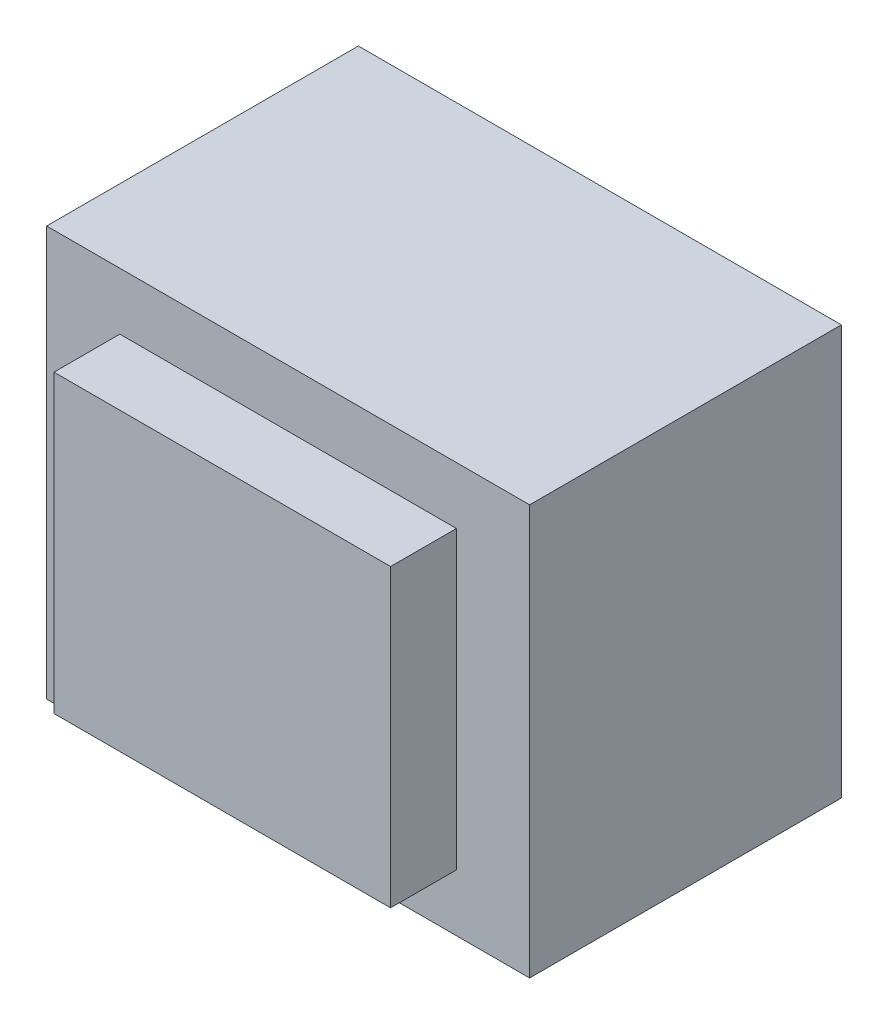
ISO-10303-21;
HEADER;
FILE_DESCRIPTION(('STEP AP214'),'2;1');
FILE_NAME('part.step','',(''),(''),'','','');
FILE_SCHEMA(('AUTOMOTIVE_DESIGN { 1 0 10303 214 1 1 1 1 }'));
ENDSEC;
DATA;
#1=APPLICATION_CONTEXT('core data for automotive mechanical design processes');
#2=APPLICATION_PROTOCOL_DEFINITION('international standard','automotive_design',2000,#1);
#3=PRODUCT_CONTEXT('',#1,'mechanical');
#4=PRODUCT('Part','Part','',(#3));
#5=PRODUCT_RELATED_PRODUCT_CATEGORY('part','',(#4));
#6=PRODUCT_DEFINITION_FORMATION('','',#4);
#7=PRODUCT_DEFINITION_CONTEXT('part definition',#1,'design');
#8=PRODUCT_DEFINITION('design','',#6,#7);
#9=PRODUCT_DEFINITION_SHAPE('','',#8);
#10=(LENGTH_UNIT() NAMED_UNIT(*) SI_UNIT(.MILLI.,.METRE.));
#11=(NAMED_UNIT(*) PLANE_ANGLE_UNIT() SI_UNIT($,.RADIAN.));
#12=(NAMED_UNIT(*) SI_UNIT($,.STERADIAN.) SOLID_ANGLE_UNIT());
#13=UNCERTAINTY_MEASURE_WITH_UNIT(LENGTH_MEASURE(1.E-05),#10,'distance_accuracy_value','');
#14=(GEOMETRIC_REPRESENTATION_CONTEXT(3) GLOBAL_UNCERTAINTY_ASSIGNED_CONTEXT((#13)) GLOBAL_UNIT_ASSIGNED_CONTEXT((#10,
#11,#12)) REPRESENTATION_CONTEXT('',''));
#15=CARTESIAN_POINT('',(0.,0.,0.));
#16=DIRECTION('',(0.,0.,1.));
#17=DIRECTION('',(1.,0.,0.));
#18=AXIS2_PLACEMENT_3D('',#15,#16,#17);
#19=CARTESIAN_POINT('',(-10.,-10.2757465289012,-2.54));
#20=DIRECTION('',(0.,0.,1.));
#21=DIRECTION('',(1.,0.,0.));
#22=AXIS2_PLACEMENT_3D('',#19,#20,#21);
#23=CYLINDRICAL_SURFACE('',#22,0.999999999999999);
#24=CARTESIAN_POINT('',(-10.,-10.2757465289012,-2.54));
#25=DIRECTION('',(0.,0.,-1.));
#26=DIRECTION('',(-1.,0.,0.));
#27=AXIS2_PLACEMENT_3D('',#24,#25,#26);
#28=CIRCLE('',#27,0.999999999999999);
#29=CARTESIAN_POINT('',(-11.,-10.2757465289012,-2.54));
#30=VERTEX_POINT('',#29);
#31=EDGE_CURVE('E11',#30,#30,#28,.T.);
#32=ORIENTED_EDGE('',*,*,#31,.F.);
#33=EDGE_LOOP('',(#32));
#34=FACE_BOUND('',#33,.T.);
#35=CARTESIAN_POINT('',(-10.,-10.2757465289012,0.));
#36=DIRECTION('',(0.,0.,-1.));
#37=DIRECTION('',(-1.,0.,0.));
#38=AXIS2_PLACEMENT_3D('',#35,#36,#37);
#39=CIRCLE('',#38,0.999999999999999);
#40=CARTESIAN_POINT('',(-11.,-10.2757465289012,0.));
#41=VERTEX_POINT('',#40);
#42=EDGE_CURVE('E41',#41,#41,#39,.T.);
#43=ORIENTED_EDGE('',*,*,#42,.T.);
#44=EDGE_LOOP('',(#43));
#45=FACE_BOUND('',#44,.T.);
#46=ADVANCED_FACE('F38',(#34,#45),#23,.T.);
#47=CARTESIAN_POINT('',(-10.,-10.2757465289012,-2.54));
#48=DIRECTION('',(0.,0.,-1.));
#49=DIRECTION('',(-1.,0.,0.));
#50=AXIS2_PLACEMENT_3D('',#47,#48,#49);
#51=PLANE('',#50);
#52=ORIENTED_EDGE('',*,*,#31,.T.);
#53=EDGE_LOOP('',(#52));
#54=FACE_BOUND('',#53,.T.);
#55=ADVANCED_FACE('F53',(#54),#51,.T.);
#56=CARTESIAN_POINT('',(-10.,-10.2757465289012,0.));
#57=DIRECTION('',(0.,0.,-1.));
#58=DIRECTION('',(-1.,0.,0.));
#59=AXIS2_PLACEMENT_3D('',#56,#57,#58);
#60=PLANE('',#59);
#61=ORIENTED_EDGE('',*,*,#42,.F.);
#62=EDGE_LOOP('',(#61));
#63=FACE_BOUND('',#62,.T.);
#64=ADVANCED_FACE('F51',(#63),#60,.F.);
#65=CLOSED_SHELL('',(#46,#55,#64));
#66=MANIFOLD_SOLID_BREP('B2',#65);
#67=CARTESIAN_POINT('',(-5.,-10.,-2.54));
#68=DIRECTION('',(0.,0.,1.));
#69=DIRECTION('',(1.,0.,0.));
#70=AXIS2_PLACEMENT_3D('',#67,#68,#69);
#71=CYLINDRICAL_SURFACE('',#70,1.);
#72=CARTESIAN_POINT('',(-5.,-10.,-2.54));
#73=DIRECTION('',(0.,0.,-1.));
#74=DIRECTION('',(-1.,0.,0.));
#75=AXIS2_PLACEMENT_3D('',#72,#73,#74);
#76=CIRCLE('',#75,1.);
#77=CARTESIAN_POINT('',(-6.,-10.,-2.54));
#78=VERTEX_POINT('',#77);
#79=EDGE_CURVE('E37',#78,#78,#76,.T.);
#80=ORIENTED_EDGE('',*,*,#79,.F.);
#81=EDGE_LOOP('',(#80));
#82=FACE_BOUND('',#81,.T.);
#83=CARTESIAN_POINT('',(-5.,-10.,0.));
#84=DIRECTION('',(0.,0.,-1.));
#85=DIRECTION('',(-1.,0.,0.));
#86=AXIS2_PLACEMENT_3D('',#83,#84,#85);
#87=CIRCLE('',#86,1.);
#88=CARTESIAN_POINT('',(-6.,-10.,0.));
#89=VERTEX_POINT('',#88);
#90=EDGE_CURVE('E90',#89,#89,#87,.T.);
#91=ORIENTED_EDGE('',*,*,#90,.T.);
#92=EDGE_LOOP('',(#91));
#93=FACE_BOUND('',#92,.T.);
#94=ADVANCED_FACE('F87',(#82,#93),#71,.T.);
#95=CARTESIAN_POINT('',(-5.,-10.,-2.54));
#96=DIRECTION('',(0.,0.,-1.));
#97=DIRECTION('',(-1.,0.,0.));
#98=AXIS2_PLACEMENT_3D('',#95,#96,#97);
#99=PLANE('',#98);
#100=ORIENTED_EDGE('',*,*,#79,.T.);
#101=EDGE_LOOP('',(#100));
#102=FACE_BOUND('',#101,.T.);
#103=ADVANCED_FACE('F102',(#102),#99,.T.);
#104=CARTESIAN_POINT('',(-5.,-10.,0.));
#105=DIRECTION('',(0.,0.,-1.));
#106=DIRECTION('',(-1.,0.,0.));
#107=AXIS2_PLACEMENT_3D('',#104,#105,#106);
#108=PLANE('',#107);
#109=ORIENTED_EDGE('',*,*,#90,.F.);
#110=EDGE_LOOP('',(#109));
#111=FACE_BOUND('',#110,.T.);
#112=ADVANCED_FACE('F100',(#111),#108,.F.);
#113=CLOSED_SHELL('',(#94,#103,#112));
#114=MANIFOLD_SOLID_BREP('B6',#113);
#115=CARTESIAN_POINT('',(0.,-10.,-2.54));
#116=DIRECTION('',(0.,0.,1.));
#117=DIRECTION('',(1.,0.,0.));
#118=AXIS2_PLACEMENT_3D('',#115,#116,#117);
#119=CYLINDRICAL_SURFACE('',#118,1.);
#120=CARTESIAN_POINT('',(0.,-10.,-2.54));
#121=DIRECTION('',(0.,0.,-1.));
#122=DIRECTION('',(-1.,0.,0.));
#123=AXIS2_PLACEMENT_3D('',#120,#121,#122);
#124=CIRCLE('',#123,1.);
#125=CARTESIAN_POINT('',(-1.,-10.,-2.54));
#126=VERTEX_POINT('',#125);
#127=EDGE_CURVE('E86',#126,#126,#124,.T.);
#128=ORIENTED_EDGE('',*,*,#127,.F.);
#129=EDGE_LOOP('',(#128));
#130=FACE_BOUND('',#129,.T.);
#131=CARTESIAN_POINT('',(0.,-10.,0.));
#132=DIRECTION('',(0.,0.,-1.));
#133=DIRECTION('',(-1.,0.,0.));
#134=AXIS2_PLACEMENT_3D('',#131,#132,#133);
#135=CIRCLE('',#134,1.);
#136=CARTESIAN_POINT('',(-1.,-10.,0.));
#137=VERTEX_POINT('',#136);
#138=EDGE_CURVE('E139',#137,#137,#135,.T.);
#139=ORIENTED_EDGE('',*,*,#138,.T.);
#140=EDGE_LOOP('',(#139));
#141=FACE_BOUND('',#140,.T.);
#142=ADVANCED_FACE('F136',(#130,#141),#119,.T.);
#143=CARTESIAN_POINT('',(0.,-10.,-2.54));
#144=DIRECTION('',(0.,0.,-1.));
#145=DIRECTION('',(-1.,0.,0.));
#146=AXIS2_PLACEMENT_3D('',#143,#144,#145);
#147=PLANE('',#146);
#148=ORIENTED_EDGE('',*,*,#127,.T.);
#149=EDGE_LOOP('',(#148));
#150=FACE_BOUND('',#149,.T.);
#151=ADVANCED_FACE('F151',(#150),#147,.T.);
#152=CARTESIAN_POINT('',(0.,-10.,0.));
#153=DIRECTION('',(0.,0.,-1.));
#154=DIRECTION('',(-1.,0.,0.));
#155=AXIS2_PLACEMENT_3D('',#152,#153,#154);
#156=PLANE('',#155);
#157=ORIENTED_EDGE('',*,*,#138,.F.);
#158=EDGE_LOOP('',(#157));
#159=FACE_BOUND('',#158,.T.);
#160=ADVANCED_FACE('F149',(#159),#156,.F.);
#161=CLOSED_SHELL('',(#142,#151,#160));
#162=MANIFOLD_SOLID_BREP('B32',#161);
#163=CARTESIAN_POINT('',(5.,-10.,-2.54));
#164=DIRECTION('',(0.,0.,1.));
#165=DIRECTION('',(1.,0.,0.));
#166=AXIS2_PLACEMENT_3D('',#163,#164,#165);
#167=CYLINDRICAL_SURFACE('',#166,1.);
#168=CARTESIAN_POINT('',(5.,-10.,-2.54));
#169=DIRECTION('',(0.,0.,-1.));
#170=DIRECTION('',(-1.,0.,0.));
#171=AXIS2_PLACEMENT_3D('',#168,#169,#170);
#172=CIRCLE('',#171,1.);
#173=CARTESIAN_POINT('',(4.,-10.,-2.54));
#174=VERTEX_POINT('',#173);
#175=EDGE_CURVE('E135',#174,#174,#172,.T.);
#176=ORIENTED_EDGE('',*,*,#175,.F.);
#177=EDGE_LOOP('',(#176));
#178=FACE_BOUND('',#177,.T.);
#179=CARTESIAN_POINT('',(5.,-10.,0.));
#180=DIRECTION('',(0.,0.,-1.));
#181=DIRECTION('',(-1.,0.,0.));
#182=AXIS2_PLACEMENT_3D('',#179,#180,#181);
#183=CIRCLE('',#182,1.);
#184=CARTESIAN_POINT('',(4.,-10.,0.));
#185=VERTEX_POINT('',#184);
#186=EDGE_CURVE('E188',#185,#185,#183,.T.);
#187=ORIENTED_EDGE('',*,*,#186,.T.);
#188=EDGE_LOOP('',(#187));
#189=FACE_BOUND('',#188,.T.);
#190=ADVANCED_FACE('F185',(#178,#189),#167,.T.);
#191=CARTESIAN_POINT('',(5.,-10.,-2.54));
#192=DIRECTION('',(0.,0.,-1.));
#193=DIRECTION('',(-1.,0.,0.));
#194=AXIS2_PLACEMENT_3D('',#191,#192,#193);
#195=PLANE('',#194);
#196=ORIENTED_EDGE('',*,*,#175,.T.);
#197=EDGE_LOOP('',(#196));
#198=FACE_BOUND('',#197,.T.);
#199=ADVANCED_FACE('F200',(#198),#195,.T.);
#200=CARTESIAN_POINT('',(5.,-10.,0.));
#201=DIRECTION('',(0.,0.,-1.));
#202=DIRECTION('',(-1.,0.,0.));
#203=AXIS2_PLACEMENT_3D('',#200,#201,#202);
#204=PLANE('',#203);
#205=ORIENTED_EDGE('',*,*,#186,.F.);
#206=EDGE_LOOP('',(#205));
#207=FACE_BOUND('',#206,.T.);
#208=ADVANCED_FACE('F198',(#207),#204,.F.);
#209=CLOSED_SHELL('',(#190,#199,#208));
#210=MANIFOLD_SOLID_BREP('B81',#209);
#211=CARTESIAN_POINT('',(10.,-10.,-2.54));
#212=DIRECTION('',(0.,0.,1.));
#213=DIRECTION('',(1.,0.,0.));
#214=AXIS2_PLACEMENT_3D('',#211,#212,#213);
#215=CYLINDRICAL_SURFACE('',#214,0.999999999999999);
#216=CARTESIAN_POINT('',(10.,-10.,-2.54));
#217=DIRECTION('',(0.,0.,-1.));
#218=DIRECTION('',(-1.,0.,0.));
#219=AXIS2_PLACEMENT_3D('',#216,#217,#218);
#220=CIRCLE('',#219,0.999999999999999);
#221=CARTESIAN_POINT('',(9.,-10.,-2.54));
#222=VERTEX_POINT('',#221);
#223=EDGE_CURVE('E184',#222,#222,#220,.T.);
#224=ORIENTED_EDGE('',*,*,#223,.F.);
#225=EDGE_LOOP('',(#224));
#226=FACE_BOUND('',#225,.T.);
#227=CARTESIAN_POINT('',(10.,-10.,0.));
#228=DIRECTION('',(0.,0.,-1.));
#229=DIRECTION('',(-1.,0.,0.));
#230=AXIS2_PLACEMENT_3D('',#227,#228,#229);
#231=CIRCLE('',#230,0.999999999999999);
#232=CARTESIAN_POINT('',(9.,-10.,0.));
#233=VERTEX_POINT('',#232);
#234=EDGE_CURVE('E237',#233,#233,#231,.T.);
#235=ORIENTED_EDGE('',*,*,#234,.T.);
#236=EDGE_LOOP('',(#235));
#237=FACE_BOUND('',#236,.T.);
#238=ADVANCED_FACE('F234',(#226,#237),#215,.T.);
#239=CARTESIAN_POINT('',(10.,-10.,-2.54));
#240=DIRECTION('',(0.,0.,-1.));
#241=DIRECTION('',(-1.,0.,0.));
#242=AXIS2_PLACEMENT_3D('',#239,#240,#241);
#243=PLANE('',#242);
#244=ORIENTED_EDGE('',*,*,#223,.T.);
#245=EDGE_LOOP('',(#244));
#246=FACE_BOUND('',#245,.T.);
#247=ADVANCED_FACE('F249',(#246),#243,.T.);
#248=CARTESIAN_POINT('',(10.,-10.,0.));
#249=DIRECTION('',(0.,0.,-1.));
#250=DIRECTION('',(-1.,0.,0.));
#251=AXIS2_PLACEMENT_3D('',#248,#249,#250);
#252=PLANE('',#251);
#253=ORIENTED_EDGE('',*,*,#234,.F.);
#254=EDGE_LOOP('',(#253));
#255=FACE_BOUND('',#254,.T.);
#256=ADVANCED_FACE('F247',(#255),#252,.F.);
#257=CLOSED_SHELL('',(#238,#247,#256));
#258=MANIFOLD_SOLID_BREP('B130',#257);
#259=CARTESIAN_POINT('',(-10.,10.,-2.54));
#260=DIRECTION('',(0.,0.,1.));
#261=DIRECTION('',(1.,0.,0.));
#262=AXIS2_PLACEMENT_3D('',#259,#260,#261);
#263=CYLINDRICAL_SURFACE('',#262,0.999999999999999);
#264=CARTESIAN_POINT('',(-10.,10.,-2.54));
#265=DIRECTION('',(0.,0.,-1.));
#266=DIRECTION('',(-1.,0.,0.));
#267=AXIS2_PLACEMENT_3D('',#264,#265,#266);
#268=CIRCLE('',#267,0.999999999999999);
#269=CARTESIAN_POINT('',(-11.,10.,-2.54));
#270=VERTEX_POINT('',#269);
#271=EDGE_CURVE('E233',#270,#270,#268,.T.);
#272=ORIENTED_EDGE('',*,*,#271,.F.);
#273=EDGE_LOOP('',(#272));
#274=FACE_BOUND('',#273,.T.);
#275=CARTESIAN_POINT('',(-10.,10.,0.));
#276=DIRECTION('',(0.,0.,-1.));
#277=DIRECTION('',(-1.,0.,0.));
#278=AXIS2_PLACEMENT_3D('',#275,#276,#277);
#279=CIRCLE('',#278,0.999999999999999);
#280=CARTESIAN_POINT('',(-11.,10.,0.));
#281=VERTEX_POINT('',#280);
#282=EDGE_CURVE('E286',#281,#281,#279,.T.);
#283=ORIENTED_EDGE('',*,*,#282,.T.);
#284=EDGE_LOOP('',(#283));
#285=FACE_BOUND('',#284,.T.);
#286=ADVANCED_FACE('F283',(#274,#285),#263,.T.);
#287=CARTESIAN_POINT('',(-10.,10.,-2.54));
#288=DIRECTION('',(0.,0.,-1.));
#289=DIRECTION('',(-1.,0.,0.));
#290=AXIS2_PLACEMENT_3D('',#287,#288,#289);
#291=PLANE('',#290);
#292=ORIENTED_EDGE('',*,*,#271,.T.);
#293=EDGE_LOOP('',(#292));
#294=FACE_BOUND('',#293,.T.);
#295=ADVANCED_FACE('F298',(#294),#291,.T.);
#296=CARTESIAN_POINT('',(-10.,10.,0.));
#297=DIRECTION('',(0.,0.,-1.));
#298=DIRECTION('',(-1.,0.,0.));
#299=AXIS2_PLACEMENT_3D('',#296,#297,#298);
#300=PLANE('',#299);
#301=ORIENTED_EDGE('',*,*,#282,.F.);
#302=EDGE_LOOP('',(#301));
#303=FACE_BOUND('',#302,.T.);
#304=ADVANCED_FACE('F296',(#303),#300,.F.);
#305=CLOSED_SHELL('',(#286,#295,#304));
#306=MANIFOLD_SOLID_BREP('B179',#305);
#307=CARTESIAN_POINT('',(-5.,10.,-2.54));
#308=DIRECTION('',(0.,0.,1.));
#309=DIRECTION('',(1.,0.,0.));
#310=AXIS2_PLACEMENT_3D('',#307,#308,#309);
#311=CYLINDRICAL_SURFACE('',#310,1.);
#312=CARTESIAN_POINT('',(-5.,10.,-2.54));
#313=DIRECTION('',(0.,0.,-1.));
#314=DIRECTION('',(-1.,0.,0.));
#315=AXIS2_PLACEMENT_3D('',#312,#313,#314);
#316=CIRCLE('',#315,1.);
#317=CARTESIAN_POINT('',(-6.,10.,-2.54));
#318=VERTEX_POINT('',#317);
#319=EDGE_CURVE('E282',#318,#318,#316,.T.);
#320=ORIENTED_EDGE('',*,*,#319,.F.);
#321=EDGE_LOOP('',(#320));
#322=FACE_BOUND('',#321,.T.);
#323=CARTESIAN_POINT('',(-5.,10.,0.));
#324=DIRECTION('',(0.,0.,-1.));
#325=DIRECTION('',(-1.,0.,0.));
#326=AXIS2_PLACEMENT_3D('',#323,#324,#325);
#327=CIRCLE('',#326,1.);
#328=CARTESIAN_POINT('',(-6.,10.,0.));
#329=VERTEX_POINT('',#328);
#330=EDGE_CURVE('E335',#329,#329,#327,.T.);
#331=ORIENTED_EDGE('',*,*,#330,.T.);
#332=EDGE_LOOP('',(#331));
#333=FACE_BOUND('',#332,.T.);
#334=ADVANCED_FACE('F332',(#322,#333),#311,.T.);
#335=CARTESIAN_POINT('',(-5.,10.,-2.54));
#336=DIRECTION('',(0.,0.,-1.));
#337=DIRECTION('',(-1.,0.,0.));
#338=AXIS2_PLACEMENT_3D('',#335,#336,#337);
#339=PLANE('',#338);
#340=ORIENTED_EDGE('',*,*,#319,.T.);
#341=EDGE_LOOP('',(#340));
#342=FACE_BOUND('',#341,.T.);
#343=ADVANCED_FACE('F347',(#342),#339,.T.);
#344=CARTESIAN_POINT('',(-5.,10.,0.));
#345=DIRECTION('',(0.,0.,-1.));
#346=DIRECTION('',(-1.,0.,0.));
#347=AXIS2_PLACEMENT_3D('',#344,#345,#346);
#348=PLANE('',#347);
#349=ORIENTED_EDGE('',*,*,#330,.F.);
#350=EDGE_LOOP('',(#349));
#351=FACE_BOUND('',#350,.T.);
#352=ADVANCED_FACE('F345',(#351),#348,.F.);
#353=CLOSED_SHELL('',(#334,#343,#352));
#354=MANIFOLD_SOLID_BREP('B228',#353);
#355=CARTESIAN_POINT('',(0.,10.,-2.54));
#356=DIRECTION('',(0.,0.,1.));
#357=DIRECTION('',(1.,0.,0.));
#358=AXIS2_PLACEMENT_3D('',#355,#356,#357);
#359=CYLINDRICAL_SURFACE('',#358,1.);
#360=CARTESIAN_POINT('',(0.,10.,-2.54));
#361=DIRECTION('',(0.,0.,-1.));
#362=DIRECTION('',(-1.,0.,0.));
#363=AXIS2_PLACEMENT_3D('',#360,#361,#362);
#364=CIRCLE('',#363,1.);
#365=CARTESIAN_POINT('',(-1.,10.,-2.54));
#366=VERTEX_POINT('',#365);
#367=EDGE_CURVE('E331',#366,#366,#364,.T.);
#368=ORIENTED_EDGE('',*,*,#367,.F.);
#369=EDGE_LOOP('',(#368));
#370=FACE_BOUND('',#369,.T.);
#371=CARTESIAN_POINT('',(0.,10.,0.));
#372=DIRECTION('',(0.,0.,-1.));
#373=DIRECTION('',(-1.,0.,0.));
#374=AXIS2_PLACEMENT_3D('',#371,#372,#373);
#375=CIRCLE('',#374,1.);
#376=CARTESIAN_POINT('',(-1.,10.,0.));
#377=VERTEX_POINT('',#376);
#378=EDGE_CURVE('E384',#377,#377,#375,.T.);
#379=ORIENTED_EDGE('',*,*,#378,.T.);
#380=EDGE_LOOP('',(#379));
#381=FACE_BOUND('',#380,.T.);
#382=ADVANCED_FACE('F381',(#370,#381),#359,.T.);
#383=CARTESIAN_POINT('',(0.,10.,-2.54));
#384=DIRECTION('',(0.,0.,-1.));
#385=DIRECTION('',(-1.,0.,0.));
#386=AXIS2_PLACEMENT_3D('',#383,#384,#385);
#387=PLANE('',#386);
#388=ORIENTED_EDGE('',*,*,#367,.T.);
#389=EDGE_LOOP('',(#388));
#390=FACE_BOUND('',#389,.T.);
#391=ADVANCED_FACE('F396',(#390),#387,.T.);
#392=CARTESIAN_POINT('',(0.,10.,0.));
#393=DIRECTION('',(0.,0.,-1.));
#394=DIRECTION('',(-1.,0.,0.));
#395=AXIS2_PLACEMENT_3D('',#392,#393,#394);
#396=PLANE('',#395);
#397=ORIENTED_EDGE('',*,*,#378,.F.);
#398=EDGE_LOOP('',(#397));
#399=FACE_BOUND('',#398,.T.);
#400=ADVANCED_FACE('F394',(#399),#396,.F.);
#401=CLOSED_SHELL('',(#382,#391,#400));
#402=MANIFOLD_SOLID_BREP('B277',#401);
#403=CARTESIAN_POINT('',(5.,10.,-2.54));
#404=DIRECTION('',(0.,0.,1.));
#405=DIRECTION('',(1.,0.,0.));
#406=AXIS2_PLACEMENT_3D('',#403,#404,#405);
#407=CYLINDRICAL_SURFACE('',#406,1.);
#408=CARTESIAN_POINT('',(5.,10.,-2.54));
#409=DIRECTION('',(0.,0.,-1.));
#410=DIRECTION('',(-1.,0.,0.));
#411=AXIS2_PLACEMENT_3D('',#408,#409,#410);
#412=CIRCLE('',#411,1.);
#413=CARTESIAN_POINT('',(4.,10.,-2.54));
#414=VERTEX_POINT('',#413);
#415=EDGE_CURVE('E380',#414,#414,#412,.T.);
#416=ORIENTED_EDGE('',*,*,#415,.F.);
#417=EDGE_LOOP('',(#416));
#418=FACE_BOUND('',#417,.T.);
#419=CARTESIAN_POINT('',(5.,10.,0.));
#420=DIRECTION('',(0.,0.,-1.));
#421=DIRECTION('',(-1.,0.,0.));
#422=AXIS2_PLACEMENT_3D('',#419,#420,#421);
#423=CIRCLE('',#422,1.);
#424=CARTESIAN_POINT('',(4.,10.,0.));
#425=VERTEX_POINT('',#424);
#426=EDGE_CURVE('E433',#425,#425,#423,.T.);
#427=ORIENTED_EDGE('',*,*,#426,.T.);
#428=EDGE_LOOP('',(#427));
#429=FACE_BOUND('',#428,.T.);
#430=ADVANCED_FACE('F430',(#418,#429),#407,.T.);
#431=CARTESIAN_POINT('',(5.,10.,-2.54));
#432=DIRECTION('',(0.,0.,-1.));
#433=DIRECTION('',(-1.,0.,0.));
#434=AXIS2_PLACEMENT_3D('',#431,#432,#433);
#435=PLANE('',#434);
#436=ORIENTED_EDGE('',*,*,#415,.T.);
#437=EDGE_LOOP('',(#436));
#438=FACE_BOUND('',#437,.T.);
#439=ADVANCED_FACE('F445',(#438),#435,.T.);
#440=CARTESIAN_POINT('',(5.,10.,0.));
#441=DIRECTION('',(0.,0.,-1.));
#442=DIRECTION('',(-1.,0.,0.));
#443=AXIS2_PLACEMENT_3D('',#440,#441,#442);
#444=PLANE('',#443);
#445=ORIENTED_EDGE('',*,*,#426,.F.);
#446=EDGE_LOOP('',(#445));
#447=FACE_BOUND('',#446,.T.);
#448=ADVANCED_FACE('F443',(#447),#444,.F.);
#449=CLOSED_SHELL('',(#430,#439,#448));
#450=MANIFOLD_SOLID_BREP('B326',#449);
#451=CARTESIAN_POINT('',(10.,10.,-2.54));
#452=DIRECTION('',(0.,0.,1.));
#453=DIRECTION('',(1.,0.,0.));
#454=AXIS2_PLACEMENT_3D('',#451,#452,#453);
#455=CYLINDRICAL_SURFACE('',#454,0.999999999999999);
#456=CARTESIAN_POINT('',(10.,10.,-2.54));
#457=DIRECTION('',(0.,0.,-1.));
#458=DIRECTION('',(-1.,0.,0.));
#459=AXIS2_PLACEMENT_3D('',#456,#457,#458);
#460=CIRCLE('',#459,0.999999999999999);
#461=CARTESIAN_POINT('',(9.,10.,-2.54));
#462=VERTEX_POINT('',#461);
#463=EDGE_CURVE('E429',#462,#462,#460,.T.);
#464=ORIENTED_EDGE('',*,*,#463,.F.);
#465=EDGE_LOOP('',(#464));
#466=FACE_BOUND('',#465,.T.);
#467=CARTESIAN_POINT('',(10.,10.,0.));
#468=DIRECTION('',(0.,0.,-1.));
#469=DIRECTION('',(-1.,0.,0.));
#470=AXIS2_PLACEMENT_3D('',#467,#468,#469);
#471=CIRCLE('',#470,0.999999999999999);
#472=CARTESIAN_POINT('',(9.,10.,0.));
#473=VERTEX_POINT('',#472);
#474=EDGE_CURVE('E483',#473,#473,#471,.T.);
#475=ORIENTED_EDGE('',*,*,#474,.T.);
#476=EDGE_LOOP('',(#475));
#477=FACE_BOUND('',#476,.T.);
#478=ADVANCED_FACE('F480',(#466,#477),#455,.T.);
#479=CARTESIAN_POINT('',(10.,10.,-2.54));
#480=DIRECTION('',(0.,0.,-1.));
#481=DIRECTION('',(-1.,0.,0.));
#482=AXIS2_PLACEMENT_3D('',#479,#480,#481);
#483=PLANE('',#482);
#484=ORIENTED_EDGE('',*,*,#463,.T.);
#485=EDGE_LOOP('',(#484));
#486=FACE_BOUND('',#485,.T.);
#487=ADVANCED_FACE('F495',(#486),#483,.T.);
#488=CARTESIAN_POINT('',(10.,10.,0.));
#489=DIRECTION('',(0.,0.,-1.));
#490=DIRECTION('',(-1.,0.,0.));
#491=AXIS2_PLACEMENT_3D('',#488,#489,#490);
#492=PLANE('',#491);
#493=ORIENTED_EDGE('',*,*,#474,.F.);
#494=EDGE_LOOP('',(#493));
#495=FACE_BOUND('',#494,.T.);
#496=ADVANCED_FACE('F493',(#495),#492,.F.);
#497=CLOSED_SHELL('',(#478,#487,#496));
#498=MANIFOLD_SOLID_BREP('B375',#497);
#499=CARTESIAN_POINT('',(-16.5,-14.,21.3));
#500=DIRECTION('',(0.,0.,1.));
#501=DIRECTION('',(1.,0.,0.));
#502=AXIS2_PLACEMENT_3D('',#499,#500,#501);
#503=PLANE('',#502);
#504=DIRECTION('',(0.,-1.,0.));
#505=VECTOR('',#504,1.);
#506=CARTESIAN_POINT('',(-16.5,14.,21.3));
#507=LINE('',#506,#505);
#508=CARTESIAN_POINT('',(-16.5,14.,21.3));
#509=VERTEX_POINT('',#508);
#510=CARTESIAN_POINT('',(-16.5,-14.,21.3));
#511=VERTEX_POINT('',#510);
#512=EDGE_CURVE('E627',#509,#511,#507,.T.);
#513=ORIENTED_EDGE('',*,*,#512,.T.);
#514=DIRECTION('',(1.,0.,0.));
#515=VECTOR('',#514,1.);
#516=CARTESIAN_POINT('',(-16.5,-14.,21.3));
#517=LINE('',#516,#515);
#518=CARTESIAN_POINT('',(16.5,-14.,21.3));
#519=VERTEX_POINT('',#518);
#520=EDGE_CURVE('E572',#511,#519,#517,.T.);
#521=ORIENTED_EDGE('',*,*,#520,.T.);
#522=DIRECTION('',(0.,1.,0.));
#523=VECTOR('',#522,1.);
#524=CARTESIAN_POINT('',(16.5,14.,21.3));
#525=LINE('',#524,#523);
#526=CARTESIAN_POINT('',(16.5,14.,21.3));
#527=VERTEX_POINT('',#526);
#528=EDGE_CURVE('E630',#519,#527,#525,.T.);
#529=ORIENTED_EDGE('',*,*,#528,.T.);
#530=DIRECTION('',(-1.,0.,0.));
#531=VECTOR('',#530,1.);
#532=CARTESIAN_POINT('',(-16.5,14.,21.3));
#533=LINE('',#532,#531);
#534=EDGE_CURVE('E544',#527,#509,#533,.T.);
#535=ORIENTED_EDGE('',*,*,#534,.T.);
#536=EDGE_LOOP('',(#513,#521,#529,#535));
#537=FACE_BOUND('',#536,.T.);
#538=DIRECTION('',(1.,0.,0.));
#539=VECTOR('',#538,1.);
#540=CARTESIAN_POINT('',(-11.5,-10.1,21.3));
#541=LINE('',#540,#539);
#542=CARTESIAN_POINT('',(-11.5,-10.1,21.3));
#543=VERTEX_POINT('',#542);
#544=CARTESIAN_POINT('',(11.5,-10.1,21.3));
#545=VERTEX_POINT('',#544);
#546=EDGE_CURVE('E750',#543,#545,#541,.T.);
#547=ORIENTED_EDGE('',*,*,#546,.F.);
#548=DIRECTION('',(0.,-1.,0.));
#549=VECTOR('',#548,1.);
#550=CARTESIAN_POINT('',(-11.5,10.1,21.3));
#551=LINE('',#550,#549);
#552=CARTESIAN_POINT('',(-11.5,10.1,21.3));
#553=VERTEX_POINT('',#552);
#554=EDGE_CURVE('E617',#553,#543,#551,.T.);
#555=ORIENTED_EDGE('',*,*,#554,.F.);
#556=DIRECTION('',(-1.,0.,0.));
#557=VECTOR('',#556,1.);
#558=CARTESIAN_POINT('',(-11.5,10.1,21.3));
#559=LINE('',#558,#557);
#560=CARTESIAN_POINT('',(11.5,10.1,21.3));
#561=VERTEX_POINT('',#560);
#562=EDGE_CURVE('E613',#561,#553,#559,.T.);
#563=ORIENTED_EDGE('',*,*,#562,.F.);
#564=DIRECTION('',(0.,1.,0.));
#565=VECTOR('',#564,1.);
#566=CARTESIAN_POINT('',(11.5,10.1,21.3));
#567=LINE('',#566,#565);
#568=EDGE_CURVE('E747',#545,#561,#567,.T.);
#569=ORIENTED_EDGE('',*,*,#568,.F.);
#570=EDGE_LOOP('',(#547,#555,#563,#569));
#571=FACE_BOUND('',#570,.T.);
#572=ADVANCED_FACE('F520',(#537,#571),#503,.T.);
#573=CARTESIAN_POINT('',(-16.5,14.,21.3));
#574=DIRECTION('',(1.,0.,0.));
#575=DIRECTION('',(0.,0.,-1.));
#576=AXIS2_PLACEMENT_3D('',#573,#574,#575);
#577=PLANE('',#576);
#578=DIRECTION('',(0.,-1.,0.));
#579=VECTOR('',#578,1.);
#580=CARTESIAN_POINT('',(-16.5,14.,0.));
#581=LINE('',#580,#579);
#582=CARTESIAN_POINT('',(-16.5,14.,0.));
#583=VERTEX_POINT('',#582);
#584=CARTESIAN_POINT('',(-16.5,-14.,0.));
#585=VERTEX_POINT('',#584);
#586=EDGE_CURVE('E619',#583,#585,#581,.T.);
#587=ORIENTED_EDGE('',*,*,#586,.T.);
#588=DIRECTION('',(0.,0.,-1.));
#589=VECTOR('',#588,1.);
#590=CARTESIAN_POINT('',(-16.5,-14.,21.3));
#591=LINE('',#590,#589);
#592=EDGE_CURVE('E478',#511,#585,#591,.T.);
#593=ORIENTED_EDGE('',*,*,#592,.F.);
#594=ORIENTED_EDGE('',*,*,#512,.F.);
#595=DIRECTION('',(0.,0.,-1.));
#596=VECTOR('',#595,1.);
#597=CARTESIAN_POINT('',(-16.5,14.,21.3));
#598=LINE('',#597,#596);
#599=EDGE_CURVE('E632',#509,#583,#598,.T.);
#600=ORIENTED_EDGE('',*,*,#599,.T.);
#601=EDGE_LOOP('',(#587,#593,#594,#600));
#602=FACE_BOUND('',#601,.T.);
#603=ADVANCED_FACE('F522',(#602),#577,.F.);
#604=CARTESIAN_POINT('',(-16.5,-14.,21.3));
#605=DIRECTION('',(0.,1.,0.));
#606=DIRECTION('',(0.,0.,1.));
#607=AXIS2_PLACEMENT_3D('',#604,#605,#606);
#608=PLANE('',#607);
#609=DIRECTION('',(1.,0.,0.));
#610=VECTOR('',#609,1.);
#611=CARTESIAN_POINT('',(-16.5,-14.,0.));
#612=LINE('',#611,#610);
#613=CARTESIAN_POINT('',(16.5,-14.,0.));
#614=VERTEX_POINT('',#613);
#615=EDGE_CURVE('E622',#585,#614,#612,.T.);
#616=ORIENTED_EDGE('',*,*,#615,.T.);
#617=DIRECTION('',(0.,0.,-1.));
#618=VECTOR('',#617,1.);
#619=CARTESIAN_POINT('',(16.5,-14.,21.3));
#620=LINE('',#619,#618);
#621=EDGE_CURVE('E528',#519,#614,#620,.T.);
#622=ORIENTED_EDGE('',*,*,#621,.F.);
#623=ORIENTED_EDGE('',*,*,#520,.F.);
#624=ORIENTED_EDGE('',*,*,#592,.T.);
#625=EDGE_LOOP('',(#616,#622,#623,#624));
#626=FACE_BOUND('',#625,.T.);
#627=ADVANCED_FACE('F660',(#626),#608,.F.);
#628=CARTESIAN_POINT('',(16.5,14.,21.3));
#629=DIRECTION('',(-1.,0.,0.));
#630=DIRECTION('',(0.,0.,1.));
#631=AXIS2_PLACEMENT_3D('',#628,#629,#630);
#632=PLANE('',#631);
#633=DIRECTION('',(0.,1.,0.));
#634=VECTOR('',#633,1.);
#635=CARTESIAN_POINT('',(16.5,14.,0.));
#636=LINE('',#635,#634);
#637=CARTESIAN_POINT('',(16.5,14.,0.));
#638=VERTEX_POINT('',#637);
#639=EDGE_CURVE('E635',#614,#638,#636,.T.);
#640=ORIENTED_EDGE('',*,*,#639,.T.);
#641=DIRECTION('',(0.,0.,-1.));
#642=VECTOR('',#641,1.);
#643=CARTESIAN_POINT('',(16.5,14.,21.3));
#644=LINE('',#643,#642);
#645=EDGE_CURVE('E639',#527,#638,#644,.T.);
#646=ORIENTED_EDGE('',*,*,#645,.F.);
#647=ORIENTED_EDGE('',*,*,#528,.F.);
#648=ORIENTED_EDGE('',*,*,#621,.T.);
#649=EDGE_LOOP('',(#640,#646,#647,#648));
#650=FACE_BOUND('',#649,.T.);
#651=ADVANCED_FACE('F644',(#650),#632,.F.);
#652=CARTESIAN_POINT('',(-16.5,14.,21.3));
#653=DIRECTION('',(0.,-1.,0.));
#654=DIRECTION('',(0.,0.,-1.));
#655=AXIS2_PLACEMENT_3D('',#652,#653,#654);
#656=PLANE('',#655);
#657=DIRECTION('',(-1.,0.,0.));
#658=VECTOR('',#657,1.);
#659=CARTESIAN_POINT('',(-16.5,14.,0.));
#660=LINE('',#659,#658);
#661=EDGE_CURVE('E565',#638,#583,#660,.T.);
#662=ORIENTED_EDGE('',*,*,#661,.T.);
#663=ORIENTED_EDGE('',*,*,#599,.F.);
#664=ORIENTED_EDGE('',*,*,#534,.F.);
#665=ORIENTED_EDGE('',*,*,#645,.T.);
#666=EDGE_LOOP('',(#662,#663,#664,#665));
#667=FACE_BOUND('',#666,.T.);
#668=ADVANCED_FACE('F652',(#667),#656,.F.);
#669=CARTESIAN_POINT('',(-16.5,-14.,0.));
#670=DIRECTION('',(0.,0.,1.));
#671=DIRECTION('',(1.,0.,0.));
#672=AXIS2_PLACEMENT_3D('',#669,#670,#671);
#673=PLANE('',#672);
#674=ORIENTED_EDGE('',*,*,#586,.F.);
#675=ORIENTED_EDGE('',*,*,#661,.F.);
#676=ORIENTED_EDGE('',*,*,#639,.F.);
#677=ORIENTED_EDGE('',*,*,#615,.F.);
#678=EDGE_LOOP('',(#674,#675,#676,#677));
#679=FACE_BOUND('',#678,.T.);
#680=ADVANCED_FACE('F648',(#679),#673,.F.);
#681=CARTESIAN_POINT('',(-11.5,10.1,25.8));
#682=DIRECTION('',(1.,0.,0.));
#683=DIRECTION('',(0.,0.,-1.));
#684=AXIS2_PLACEMENT_3D('',#681,#682,#683);
#685=PLANE('',#684);
#686=ORIENTED_EDGE('',*,*,#554,.T.);
#687=DIRECTION('',(0.,0.,-1.));
#688=VECTOR('',#687,1.);
#689=CARTESIAN_POINT('',(-11.5,-10.1,25.8));
#690=LINE('',#689,#688);
#691=CARTESIAN_POINT('',(-11.5,-10.1,25.8));
#692=VERTEX_POINT('',#691);
#693=EDGE_CURVE('E598',#692,#543,#690,.T.);
#694=ORIENTED_EDGE('',*,*,#693,.F.);
#695=DIRECTION('',(0.,-1.,0.));
#696=VECTOR('',#695,1.);
#697=CARTESIAN_POINT('',(-11.5,10.1,25.8));
#698=LINE('',#697,#696);
#699=CARTESIAN_POINT('',(-11.5,10.1,25.8));
#700=VERTEX_POINT('',#699);
#701=EDGE_CURVE('E605',#700,#692,#698,.T.);
#702=ORIENTED_EDGE('',*,*,#701,.F.);
#703=DIRECTION('',(0.,0.,-1.));
#704=VECTOR('',#703,1.);
#705=CARTESIAN_POINT('',(-11.5,10.1,25.8));
#706=LINE('',#705,#704);
#707=EDGE_CURVE('E745',#700,#553,#706,.T.);
#708=ORIENTED_EDGE('',*,*,#707,.T.);
#709=EDGE_LOOP('',(#686,#694,#702,#708));
#710=FACE_BOUND('',#709,.T.);
#711=ADVANCED_FACE('F615',(#710),#685,.F.);
#712=CARTESIAN_POINT('',(-11.5,-10.1,25.8));
#713=DIRECTION('',(0.,1.,0.));
#714=DIRECTION('',(0.,0.,1.));
#715=AXIS2_PLACEMENT_3D('',#712,#713,#714);
#716=PLANE('',#715);
#717=ORIENTED_EDGE('',*,*,#546,.T.);
#718=DIRECTION('',(0.,0.,-1.));
#719=VECTOR('',#718,1.);
#720=CARTESIAN_POINT('',(11.5,-10.1,25.8));
#721=LINE('',#720,#719);
#722=CARTESIAN_POINT('',(11.5,-10.1,25.8));
#723=VERTEX_POINT('',#722);
#724=EDGE_CURVE('E601',#723,#545,#721,.T.);
#725=ORIENTED_EDGE('',*,*,#724,.F.);
#726=DIRECTION('',(1.,0.,0.));
#727=VECTOR('',#726,1.);
#728=CARTESIAN_POINT('',(-11.5,-10.1,25.8));
#729=LINE('',#728,#727);
#730=EDGE_CURVE('E594',#692,#723,#729,.T.);
#731=ORIENTED_EDGE('',*,*,#730,.F.);
#732=ORIENTED_EDGE('',*,*,#693,.T.);
#733=EDGE_LOOP('',(#717,#725,#731,#732));
#734=FACE_BOUND('',#733,.T.);
#735=ADVANCED_FACE('F596',(#734),#716,.F.);
#736=CARTESIAN_POINT('',(11.5,10.1,25.8));
#737=DIRECTION('',(-1.,0.,0.));
#738=DIRECTION('',(0.,0.,1.));
#739=AXIS2_PLACEMENT_3D('',#736,#737,#738);
#740=PLANE('',#739);
#741=ORIENTED_EDGE('',*,*,#568,.T.);
#742=DIRECTION('',(0.,0.,-1.));
#743=VECTOR('',#742,1.);
#744=CARTESIAN_POINT('',(11.5,10.1,25.8));
#745=LINE('',#744,#743);
#746=CARTESIAN_POINT('',(11.5,10.1,25.8));
#747=VERTEX_POINT('',#746);
#748=EDGE_CURVE('E535',#747,#561,#745,.T.);
#749=ORIENTED_EDGE('',*,*,#748,.F.);
#750=DIRECTION('',(0.,1.,0.));
#751=VECTOR('',#750,1.);
#752=CARTESIAN_POINT('',(11.5,10.1,25.8));
#753=LINE('',#752,#751);
#754=EDGE_CURVE('E604',#723,#747,#753,.T.);
#755=ORIENTED_EDGE('',*,*,#754,.F.);
#756=ORIENTED_EDGE('',*,*,#724,.T.);
#757=EDGE_LOOP('',(#741,#749,#755,#756));
#758=FACE_BOUND('',#757,.T.);
#759=ADVANCED_FACE('F673',(#758),#740,.F.);
#760=CARTESIAN_POINT('',(-11.5,10.1,25.8));
#761=DIRECTION('',(0.,-1.,0.));
#762=DIRECTION('',(0.,0.,-1.));
#763=AXIS2_PLACEMENT_3D('',#760,#761,#762);
#764=PLANE('',#763);
#765=ORIENTED_EDGE('',*,*,#562,.T.);
#766=ORIENTED_EDGE('',*,*,#707,.F.);
#767=DIRECTION('',(-1.,0.,0.));
#768=VECTOR('',#767,1.);
#769=CARTESIAN_POINT('',(-11.5,10.1,25.8));
#770=LINE('',#769,#768);
#771=EDGE_CURVE('E609',#747,#700,#770,.T.);
#772=ORIENTED_EDGE('',*,*,#771,.F.);
#773=ORIENTED_EDGE('',*,*,#748,.T.);
#774=EDGE_LOOP('',(#765,#766,#772,#773));
#775=FACE_BOUND('',#774,.T.);
#776=ADVANCED_FACE('F676',(#775),#764,.F.);
#777=CARTESIAN_POINT('',(-11.5,-10.1,25.8));
#778=DIRECTION('',(0.,0.,1.));
#779=DIRECTION('',(1.,0.,0.));
#780=AXIS2_PLACEMENT_3D('',#777,#778,#779);
#781=PLANE('',#780);
#782=ORIENTED_EDGE('',*,*,#701,.T.);
#783=ORIENTED_EDGE('',*,*,#730,.T.);
#784=ORIENTED_EDGE('',*,*,#754,.T.);
#785=ORIENTED_EDGE('',*,*,#771,.T.);
#786=EDGE_LOOP('',(#782,#783,#784,#785));
#787=FACE_BOUND('',#786,.T.);
#788=ADVANCED_FACE('F608',(#787),#781,.T.);
#789=CLOSED_SHELL('',(#572,#603,#627,#651,#668,#680,#711,#735,#759,#776,#788));
#790=MANIFOLD_SOLID_BREP('B424',#789);
#791=ADVANCED_BREP_SHAPE_REPRESENTATION('',(#18,#66,#114,#162,#210,#258,#306,#354,#402,#450,
#498,#790),#14);
#792=SHAPE_DEFINITION_REPRESENTATION(#9,#791);
ENDSEC;
END-ISO-10303-21;
